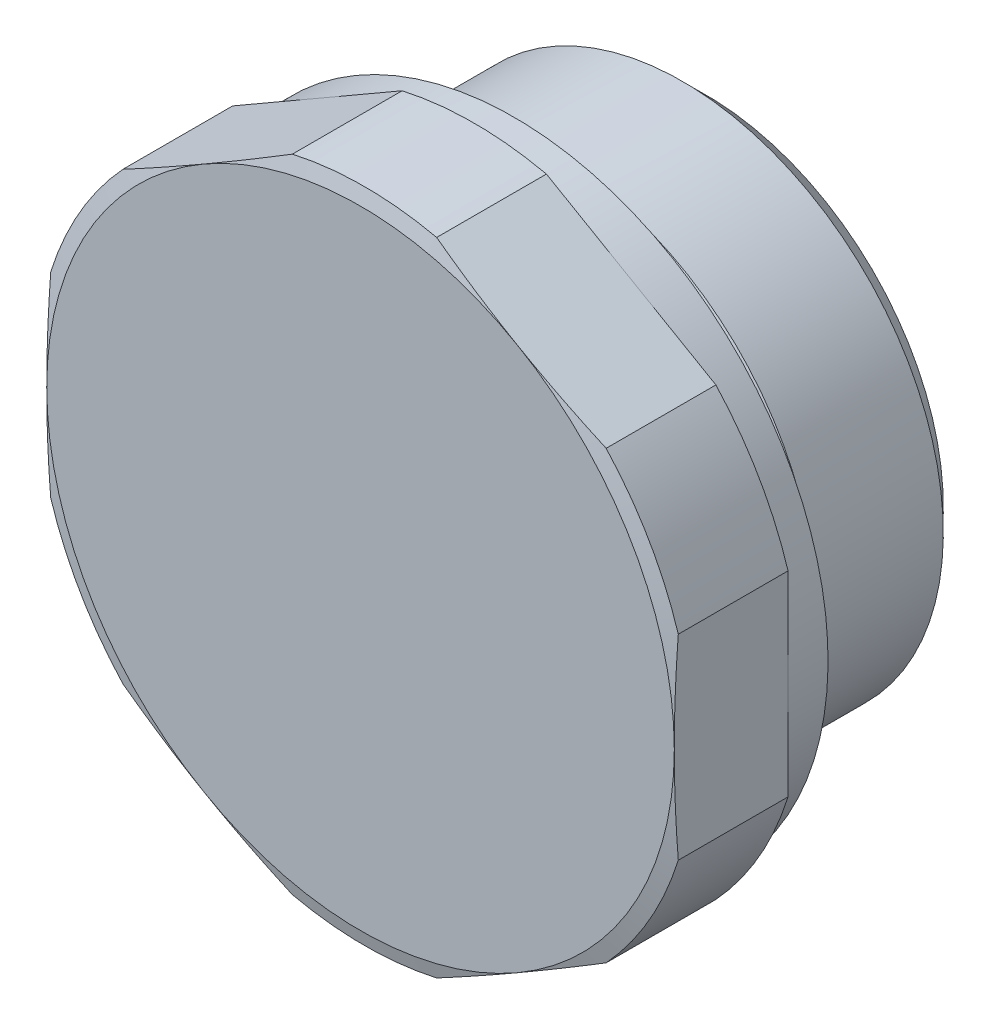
ISO-10303-21;
HEADER;
FILE_DESCRIPTION(('STEP AP214'),'2;1');
FILE_NAME('part.step','',(''),(''),'','','');
FILE_SCHEMA(('AUTOMOTIVE_DESIGN { 1 0 10303 214 1 1 1 1 }'));
ENDSEC;
DATA;
#1=APPLICATION_CONTEXT('core data for automotive mechanical design processes');
#2=APPLICATION_PROTOCOL_DEFINITION('international standard','automotive_design',2000,#1);
#3=PRODUCT_CONTEXT('',#1,'mechanical');
#4=PRODUCT('Part','Part','',(#3));
#5=PRODUCT_RELATED_PRODUCT_CATEGORY('part','',(#4));
#6=PRODUCT_DEFINITION_FORMATION('','',#4);
#7=PRODUCT_DEFINITION_CONTEXT('part definition',#1,'design');
#8=PRODUCT_DEFINITION('design','',#6,#7);
#9=PRODUCT_DEFINITION_SHAPE('','',#8);
#10=(LENGTH_UNIT() NAMED_UNIT(*) SI_UNIT(.MILLI.,.METRE.));
#11=(NAMED_UNIT(*) PLANE_ANGLE_UNIT() SI_UNIT($,.RADIAN.));
#12=(NAMED_UNIT(*) SI_UNIT($,.STERADIAN.) SOLID_ANGLE_UNIT());
#13=UNCERTAINTY_MEASURE_WITH_UNIT(LENGTH_MEASURE(1.E-05),#10,'distance_accuracy_value','');
#14=(GEOMETRIC_REPRESENTATION_CONTEXT(3) GLOBAL_UNCERTAINTY_ASSIGNED_CONTEXT((#13)) GLOBAL_UNIT_ASSIGNED_CONTEXT((#10,
#11,#12)) REPRESENTATION_CONTEXT('',''));
#15=CARTESIAN_POINT('',(0.,0.,0.));
#16=DIRECTION('',(0.,0.,1.));
#17=DIRECTION('',(1.,0.,0.));
#18=AXIS2_PLACEMENT_3D('',#15,#16,#17);
#19=CARTESIAN_POINT('',(0.,0.,-6.99999999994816));
#20=DIRECTION('',(0.,0.,-1.));
#21=DIRECTION('',(1.,0.,0.));
#22=AXIS2_PLACEMENT_3D('',#19,#20,#21);
#23=CONICAL_SURFACE('',#22,6.50000000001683,1.02974425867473);
#24=CARTESIAN_POINT('',(0.,0.,-3.09440597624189));
#25=VERTEX_POINT('',#24);
#26=VERTEX_LOOP('',#25);
#27=FACE_BOUND('',#26,.T.);
#28=CARTESIAN_POINT('',(0.,0.,-7.));
#29=DIRECTION('',(0.,0.,1.));
#30=DIRECTION('',(0.,-1.,0.));
#31=AXIS2_PLACEMENT_3D('',#28,#29,#30);
#32=CIRCLE('',#31,6.5);
#33=CARTESIAN_POINT('',(0.,-6.5,-7.));
#34=VERTEX_POINT('',#33);
#35=EDGE_CURVE('E410',#34,#34,#32,.F.);
#36=ORIENTED_EDGE('',*,*,#35,.T.);
#37=EDGE_LOOP('',(#36));
#38=FACE_BOUND('',#37,.T.);
#39=ADVANCED_FACE('F14',(#27,#38),#23,.F.);
#40=CARTESIAN_POINT('',(0.,0.,-14.));
#41=DIRECTION('',(0.,0.,1.));
#42=DIRECTION('',(0.,-1.,0.));
#43=AXIS2_PLACEMENT_3D('',#40,#41,#42);
#44=CYLINDRICAL_SURFACE('',#43,6.5);
#45=CARTESIAN_POINT('',(0.,0.,-14.));
#46=DIRECTION('',(0.,0.,1.));
#47=DIRECTION('',(0.,-1.,0.));
#48=AXIS2_PLACEMENT_3D('',#45,#46,#47);
#49=CIRCLE('',#48,6.5);
#50=CARTESIAN_POINT('',(0.,-6.5,-14.));
#51=VERTEX_POINT('',#50);
#52=EDGE_CURVE('E17',#51,#51,#49,.F.);
#53=ORIENTED_EDGE('',*,*,#52,.T.);
#54=EDGE_LOOP('',(#53));
#55=FACE_BOUND('',#54,.T.);
#56=ORIENTED_EDGE('',*,*,#35,.F.);
#57=EDGE_LOOP('',(#56));
#58=FACE_BOUND('',#57,.T.);
#59=ADVANCED_FACE('F753',(#55,#58),#44,.F.);
#60=CARTESIAN_POINT('',(15.1455,0.,-14.));
#61=DIRECTION('',(0.,0.,1.));
#62=DIRECTION('',(0.,-1.,0.));
#63=AXIS2_PLACEMENT_3D('',#60,#61,#62);
#64=PLANE('',#63);
#65=CARTESIAN_POINT('',(0.,0.,-14.));
#66=DIRECTION('',(0.,0.,1.));
#67=DIRECTION('',(0.,-1.,0.));
#68=AXIS2_PLACEMENT_3D('',#65,#66,#67);
#69=CIRCLE('',#68,15.1455);
#70=CARTESIAN_POINT('',(0.,-15.1455,-14.));
#71=VERTEX_POINT('',#70);
#72=EDGE_CURVE('E407',#71,#71,#69,.T.);
#73=ORIENTED_EDGE('',*,*,#72,.F.);
#74=EDGE_LOOP('',(#73));
#75=FACE_BOUND('',#74,.T.);
#76=ORIENTED_EDGE('',*,*,#52,.F.);
#77=EDGE_LOOP('',(#76));
#78=FACE_BOUND('',#77,.T.);
#79=ADVANCED_FACE('F744',(#75,#78),#64,.F.);
#80=CARTESIAN_POINT('',(0.,0.,-12.521));
#81=DIRECTION('',(0.,0.,1.));
#82=DIRECTION('',(0.,-1.,0.));
#83=AXIS2_PLACEMENT_3D('',#80,#81,#82);
#84=CONICAL_SURFACE('',#83,16.6245,0.785398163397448);
#85=CARTESIAN_POINT('',(0.,0.,-12.521));
#86=DIRECTION('',(0.,0.,1.));
#87=DIRECTION('',(0.,-1.,0.));
#88=AXIS2_PLACEMENT_3D('',#85,#86,#87);
#89=CIRCLE('',#88,16.6245);
#90=CARTESIAN_POINT('',(0.,-16.6245,-12.521));
#91=VERTEX_POINT('',#90);
#92=EDGE_CURVE('E402',#91,#91,#89,.T.);
#93=ORIENTED_EDGE('',*,*,#92,.F.);
#94=EDGE_LOOP('',(#93));
#95=FACE_BOUND('',#94,.T.);
#96=ORIENTED_EDGE('',*,*,#72,.T.);
#97=EDGE_LOOP('',(#96));
#98=FACE_BOUND('',#97,.T.);
#99=ADVANCED_FACE('F735',(#95,#98),#84,.T.);
#100=CARTESIAN_POINT('',(0.,0.,-14.));
#101=DIRECTION('',(0.,0.,1.));
#102=DIRECTION('',(0.,-1.,0.));
#103=AXIS2_PLACEMENT_3D('',#100,#101,#102);
#104=CYLINDRICAL_SURFACE('',#103,16.6245);
#105=CARTESIAN_POINT('',(0.,0.,-4.35390104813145));
#106=DIRECTION('',(0.,0.,-1.));
#107=DIRECTION('',(0.,1.,0.));
#108=AXIS2_PLACEMENT_3D('',#105,#106,#107);
#109=CIRCLE('',#108,16.6245);
#110=CARTESIAN_POINT('',(0.,16.6245,-4.35390104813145));
#111=VERTEX_POINT('',#110);
#112=EDGE_CURVE('E398',#111,#111,#109,.F.);
#113=ORIENTED_EDGE('',*,*,#112,.F.);
#114=EDGE_LOOP('',(#113));
#115=FACE_BOUND('',#114,.T.);
#116=ORIENTED_EDGE('',*,*,#92,.T.);
#117=EDGE_LOOP('',(#116));
#118=FACE_BOUND('',#117,.T.);
#119=ADVANCED_FACE('F726',(#115,#118),#104,.T.);
#120=CARTESIAN_POINT('',(0.,0.,-4.35390104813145));
#121=DIRECTION('',(0.,0.,-1.));
#122=DIRECTION('',(0.,1.,0.));
#123=AXIS2_PLACEMENT_3D('',#120,#121,#122);
#124=CONICAL_SURFACE('',#123,16.6245,1.0471975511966);
#125=CARTESIAN_POINT('',(0.,0.,-3.5));
#126=DIRECTION('',(0.,0.,-1.));
#127=DIRECTION('',(0.,1.,0.));
#128=AXIS2_PLACEMENT_3D('',#125,#126,#127);
#129=CIRCLE('',#128,15.1455);
#130=CARTESIAN_POINT('',(0.,15.1455,-3.5));
#131=VERTEX_POINT('',#130);
#132=EDGE_CURVE('E401',#131,#131,#129,.T.);
#133=ORIENTED_EDGE('',*,*,#132,.T.);
#134=EDGE_LOOP('',(#133));
#135=FACE_BOUND('',#134,.T.);
#136=ORIENTED_EDGE('',*,*,#112,.T.);
#137=EDGE_LOOP('',(#136));
#138=FACE_BOUND('',#137,.T.);
#139=ADVANCED_FACE('F717',(#135,#138),#124,.T.);
#140=CARTESIAN_POINT('',(14.5,0.,-3.5));
#141=DIRECTION('',(0.,0.,-1.));
#142=DIRECTION('',(0.,1.,0.));
#143=AXIS2_PLACEMENT_3D('',#140,#141,#142);
#144=PLANE('',#143);
#145=CARTESIAN_POINT('',(0.,0.,-3.5));
#146=DIRECTION('',(0.,0.,1.));
#147=DIRECTION('',(-1.,0.,0.));
#148=AXIS2_PLACEMENT_3D('',#145,#146,#147);
#149=CIRCLE('',#148,14.5);
#150=CARTESIAN_POINT('',(-14.5,0.,-3.5));
#151=VERTEX_POINT('',#150);
#152=EDGE_CURVE('E425',#151,#151,#149,.T.);
#153=ORIENTED_EDGE('',*,*,#152,.F.);
#154=EDGE_LOOP('',(#153));
#155=FACE_BOUND('',#154,.T.);
#156=ORIENTED_EDGE('',*,*,#132,.F.);
#157=EDGE_LOOP('',(#156));
#158=FACE_BOUND('',#157,.T.);
#159=ADVANCED_FACE('F708',(#155,#158),#144,.F.);
#160=CARTESIAN_POINT('',(0.,0.,0.));
#161=DIRECTION('',(0.,0.,1.));
#162=DIRECTION('',(-1.,0.,0.));
#163=AXIS2_PLACEMENT_3D('',#160,#161,#162);
#164=CONICAL_SURFACE('',#163,16.5,0.519146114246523);
#165=CARTESIAN_POINT('',(0.,0.,0.));
#166=DIRECTION('',(0.,0.,1.));
#167=DIRECTION('',(-1.,0.,0.));
#168=AXIS2_PLACEMENT_3D('',#165,#166,#167);
#169=CIRCLE('',#168,16.5);
#170=CARTESIAN_POINT('',(-16.5,0.,0.));
#171=VERTEX_POINT('',#170);
#172=EDGE_CURVE('E428',#171,#171,#169,.F.);
#173=ORIENTED_EDGE('',*,*,#172,.T.);
#174=EDGE_LOOP('',(#173));
#175=FACE_BOUND('',#174,.T.);
#176=ORIENTED_EDGE('',*,*,#152,.T.);
#177=EDGE_LOOP('',(#176));
#178=FACE_BOUND('',#177,.T.);
#179=ADVANCED_FACE('F699',(#175,#178),#164,.T.);
#180=CARTESIAN_POINT('',(20.,0.,0.));
#181=DIRECTION('',(0.,0.,1.));
#182=DIRECTION('',(0.,-1.,0.));
#183=AXIS2_PLACEMENT_3D('',#180,#181,#182);
#184=PLANE('',#183);
#185=CARTESIAN_POINT('',(0.,0.,0.));
#186=DIRECTION('',(0.,0.,1.));
#187=DIRECTION('',(0.,-1.,0.));
#188=AXIS2_PLACEMENT_3D('',#185,#186,#187);
#189=CIRCLE('',#188,16.6245);
#190=CARTESIAN_POINT('',(0.,-16.6245,0.));
#191=VERTEX_POINT('',#190);
#192=EDGE_CURVE('E431',#191,#191,#189,.F.);
#193=ORIENTED_EDGE('',*,*,#192,.T.);
#194=EDGE_LOOP('',(#193));
#195=FACE_BOUND('',#194,.T.);
#196=ORIENTED_EDGE('',*,*,#172,.F.);
#197=EDGE_LOOP('',(#196));
#198=FACE_BOUND('',#197,.T.);
#199=ADVANCED_FACE('F690',(#195,#198),#184,.F.);
#200=CARTESIAN_POINT('',(0.,0.,-1.8));
#201=DIRECTION('',(0.,0.,1.));
#202=DIRECTION('',(0.,-1.,0.));
#203=AXIS2_PLACEMENT_3D('',#200,#201,#202);
#204=CYLINDRICAL_SURFACE('',#203,16.6245);
#205=ORIENTED_EDGE('',*,*,#192,.F.);
#206=EDGE_LOOP('',(#205));
#207=FACE_BOUND('',#206,.T.);
#208=CARTESIAN_POINT('',(0.,0.,-1.8));
#209=DIRECTION('',(0.,0.,1.));
#210=DIRECTION('',(0.,-1.,0.));
#211=AXIS2_PLACEMENT_3D('',#208,#209,#210);
#212=CIRCLE('',#211,16.6245);
#213=CARTESIAN_POINT('',(0.,-16.6245,-1.8));
#214=VERTEX_POINT('',#213);
#215=EDGE_CURVE('E434',#214,#214,#212,.T.);
#216=ORIENTED_EDGE('',*,*,#215,.F.);
#217=EDGE_LOOP('',(#216));
#218=FACE_BOUND('',#217,.T.);
#219=ADVANCED_FACE('F681',(#207,#218),#204,.F.);
#220=CARTESIAN_POINT('',(16.6245,0.,-1.8));
#221=DIRECTION('',(0.,0.,-1.));
#222=DIRECTION('',(0.,1.,0.));
#223=AXIS2_PLACEMENT_3D('',#220,#221,#222);
#224=PLANE('',#223);
#225=ORIENTED_EDGE('',*,*,#215,.T.);
#226=EDGE_LOOP('',(#225));
#227=FACE_BOUND('',#226,.T.);
#228=CARTESIAN_POINT('',(0.,0.,-1.8));
#229=DIRECTION('',(0.,0.,1.));
#230=DIRECTION('',(0.,-1.,0.));
#231=AXIS2_PLACEMENT_3D('',#228,#229,#230);
#232=CIRCLE('',#231,20.);
#233=CARTESIAN_POINT('',(0.,-20.,-1.8));
#234=VERTEX_POINT('',#233);
#235=EDGE_CURVE('E437',#234,#234,#232,.T.);
#236=ORIENTED_EDGE('',*,*,#235,.F.);
#237=EDGE_LOOP('',(#236));
#238=FACE_BOUND('',#237,.T.);
#239=ADVANCED_FACE('F673',(#227,#238),#224,.T.);
#240=CARTESIAN_POINT('',(0.,0.,-14.));
#241=DIRECTION('',(0.,0.,1.));
#242=DIRECTION('',(0.,-1.,0.));
#243=AXIS2_PLACEMENT_3D('',#240,#241,#242);
#244=CYLINDRICAL_SURFACE('',#243,20.);
#245=CARTESIAN_POINT('',(0.,0.,0.75));
#246=DIRECTION('',(0.,0.,1.));
#247=DIRECTION('',(0.,-1.,0.));
#248=AXIS2_PLACEMENT_3D('',#245,#246,#247);
#249=CIRCLE('',#248,20.);
#250=CARTESIAN_POINT('',(-10.,17.3205080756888,0.75));
#251=VERTEX_POINT('',#250);
#252=CARTESIAN_POINT('',(10.,17.3205080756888,0.75));
#253=VERTEX_POINT('',#252);
#254=EDGE_CURVE('E444',#251,#253,#249,.F.);
#255=ORIENTED_EDGE('',*,*,#254,.T.);
#256=CARTESIAN_POINT('',(0.,0.,0.75));
#257=DIRECTION('',(0.,0.,1.));
#258=DIRECTION('',(0.,-1.,0.));
#259=AXIS2_PLACEMENT_3D('',#256,#257,#258);
#260=CIRCLE('',#259,20.);
#261=CARTESIAN_POINT('',(20.,0.,0.75));
#262=VERTEX_POINT('',#261);
#263=EDGE_CURVE('E447',#253,#262,#260,.F.);
#264=ORIENTED_EDGE('',*,*,#263,.T.);
#265=CARTESIAN_POINT('',(0.,0.,0.75));
#266=DIRECTION('',(0.,0.,1.));
#267=DIRECTION('',(0.,-1.,0.));
#268=AXIS2_PLACEMENT_3D('',#265,#266,#267);
#269=CIRCLE('',#268,20.);
#270=CARTESIAN_POINT('',(10.,-17.3205080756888,0.75));
#271=VERTEX_POINT('',#270);
#272=EDGE_CURVE('E450',#262,#271,#269,.F.);
#273=ORIENTED_EDGE('',*,*,#272,.T.);
#274=CARTESIAN_POINT('',(0.,0.,0.75));
#275=DIRECTION('',(0.,0.,1.));
#276=DIRECTION('',(0.,-1.,0.));
#277=AXIS2_PLACEMENT_3D('',#274,#275,#276);
#278=CIRCLE('',#277,20.);
#279=CARTESIAN_POINT('',(-10.,-17.3205080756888,0.75));
#280=VERTEX_POINT('',#279);
#281=EDGE_CURVE('E453',#271,#280,#278,.F.);
#282=ORIENTED_EDGE('',*,*,#281,.T.);
#283=CARTESIAN_POINT('',(0.,0.,0.75));
#284=DIRECTION('',(0.,0.,1.));
#285=DIRECTION('',(0.,-1.,0.));
#286=AXIS2_PLACEMENT_3D('',#283,#284,#285);
#287=CIRCLE('',#286,20.);
#288=CARTESIAN_POINT('',(-20.,0.,0.75));
#289=VERTEX_POINT('',#288);
#290=EDGE_CURVE('E136',#280,#289,#287,.F.);
#291=ORIENTED_EDGE('',*,*,#290,.T.);
#292=CARTESIAN_POINT('',(0.,0.,0.75));
#293=DIRECTION('',(0.,0.,1.));
#294=DIRECTION('',(0.,-1.,0.));
#295=AXIS2_PLACEMENT_3D('',#292,#293,#294);
#296=CIRCLE('',#295,20.);
#297=EDGE_CURVE('E441',#289,#251,#296,.F.);
#298=ORIENTED_EDGE('',*,*,#297,.T.);
#299=EDGE_LOOP('',(#255,#264,#273,#282,#291,#298));
#300=FACE_BOUND('',#299,.T.);
#301=ORIENTED_EDGE('',*,*,#235,.T.);
#302=EDGE_LOOP('',(#301));
#303=FACE_BOUND('',#302,.T.);
#304=ADVANCED_FACE('F474',(#300,#303),#244,.T.);
#305=CARTESIAN_POINT('',(23.95,0.,0.75));
#306=DIRECTION('',(0.,0.,1.));
#307=DIRECTION('',(0.,-1.,0.));
#308=AXIS2_PLACEMENT_3D('',#305,#306,#307);
#309=PLANE('',#308);
#310=DIRECTION('',(0.,-1.,0.));
#311=VECTOR('',#310,1.);
#312=CARTESIAN_POINT('',(-20.,11.5470053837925,0.75));
#313=LINE('',#312,#311);
#314=CARTESIAN_POINT('',(-20.,-6.23718686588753,0.75));
#315=VERTEX_POINT('',#314);
#316=EDGE_CURVE('E387',#289,#315,#313,.T.);
#317=ORIENTED_EDGE('',*,*,#316,.F.);
#318=ORIENTED_EDGE('',*,*,#290,.F.);
#319=DIRECTION('',(0.866025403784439,-0.5,0.));
#320=VECTOR('',#319,1.);
#321=CARTESIAN_POINT('',(-20.,-11.5470053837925,0.75));
#322=LINE('',#321,#320);
#323=CARTESIAN_POINT('',(-15.4015622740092,-14.201914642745,0.75));
#324=VERTEX_POINT('',#323);
#325=EDGE_CURVE('E391',#324,#280,#322,.T.);
#326=ORIENTED_EDGE('',*,*,#325,.F.);
#327=CARTESIAN_POINT('',(0.,0.,0.75));
#328=DIRECTION('',(0.,0.,-1.));
#329=DIRECTION('',(0.,1.,0.));
#330=AXIS2_PLACEMENT_3D('',#327,#328,#329);
#331=CIRCLE('',#330,20.95);
#332=EDGE_CURVE('E397',#315,#324,#331,.F.);
#333=ORIENTED_EDGE('',*,*,#332,.F.);
#334=EDGE_LOOP('',(#317,#318,#326,#333));
#335=FACE_BOUND('',#334,.T.);
#336=ADVANCED_FACE('F657',(#335),#309,.F.);
#337=CARTESIAN_POINT('',(23.95,0.,0.75));
#338=DIRECTION('',(0.,0.,1.));
#339=DIRECTION('',(0.,-1.,0.));
#340=AXIS2_PLACEMENT_3D('',#337,#338,#339);
#341=PLANE('',#340);
#342=DIRECTION('',(-0.866025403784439,-0.5,0.));
#343=VECTOR('',#342,1.);
#344=CARTESIAN_POINT('',(0.,23.094010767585,0.75));
#345=LINE('',#344,#343);
#346=CARTESIAN_POINT('',(-15.4015622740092,14.201914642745,0.75));
#347=VERTEX_POINT('',#346);
#348=EDGE_CURVE('E379',#251,#347,#345,.T.);
#349=ORIENTED_EDGE('',*,*,#348,.F.);
#350=ORIENTED_EDGE('',*,*,#297,.F.);
#351=DIRECTION('',(0.,-1.,0.));
#352=VECTOR('',#351,1.);
#353=CARTESIAN_POINT('',(-20.,11.5470053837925,0.75));
#354=LINE('',#353,#352);
#355=CARTESIAN_POINT('',(-20.,6.23718686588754,0.75));
#356=VERTEX_POINT('',#355);
#357=EDGE_CURVE('E383',#356,#289,#354,.T.);
#358=ORIENTED_EDGE('',*,*,#357,.F.);
#359=CARTESIAN_POINT('',(0.,0.,0.75));
#360=DIRECTION('',(0.,0.,-1.));
#361=DIRECTION('',(0.,1.,0.));
#362=AXIS2_PLACEMENT_3D('',#359,#360,#361);
#363=CIRCLE('',#362,20.95);
#364=EDGE_CURVE('E390',#347,#356,#363,.F.);
#365=ORIENTED_EDGE('',*,*,#364,.F.);
#366=EDGE_LOOP('',(#349,#350,#358,#365));
#367=FACE_BOUND('',#366,.T.);
#368=ADVANCED_FACE('F649',(#367),#341,.F.);
#369=CARTESIAN_POINT('',(23.95,0.,0.75));
#370=DIRECTION('',(0.,0.,1.));
#371=DIRECTION('',(0.,-1.,0.));
#372=AXIS2_PLACEMENT_3D('',#369,#370,#371);
#373=PLANE('',#372);
#374=DIRECTION('',(-0.866025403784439,0.5,0.));
#375=VECTOR('',#374,1.);
#376=CARTESIAN_POINT('',(20.,11.5470053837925,0.75));
#377=LINE('',#376,#375);
#378=CARTESIAN_POINT('',(4.59843772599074,20.4391015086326,0.75));
#379=VERTEX_POINT('',#378);
#380=EDGE_CURVE('E371',#253,#379,#377,.T.);
#381=ORIENTED_EDGE('',*,*,#380,.F.);
#382=ORIENTED_EDGE('',*,*,#254,.F.);
#383=DIRECTION('',(-0.866025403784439,-0.5,0.));
#384=VECTOR('',#383,1.);
#385=CARTESIAN_POINT('',(0.,23.094010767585,0.75));
#386=LINE('',#385,#384);
#387=CARTESIAN_POINT('',(-4.59843772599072,20.4391015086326,0.75));
#388=VERTEX_POINT('',#387);
#389=EDGE_CURVE('E375',#388,#251,#386,.T.);
#390=ORIENTED_EDGE('',*,*,#389,.F.);
#391=CARTESIAN_POINT('',(0.,0.,0.75));
#392=DIRECTION('',(0.,0.,-1.));
#393=DIRECTION('',(0.,1.,0.));
#394=AXIS2_PLACEMENT_3D('',#391,#392,#393);
#395=CIRCLE('',#394,20.95);
#396=EDGE_CURVE('E382',#379,#388,#395,.F.);
#397=ORIENTED_EDGE('',*,*,#396,.F.);
#398=EDGE_LOOP('',(#381,#382,#390,#397));
#399=FACE_BOUND('',#398,.T.);
#400=ADVANCED_FACE('F479',(#399),#373,.F.);
#401=CARTESIAN_POINT('',(23.95,0.,0.75));
#402=DIRECTION('',(0.,0.,1.));
#403=DIRECTION('',(0.,-1.,0.));
#404=AXIS2_PLACEMENT_3D('',#401,#402,#403);
#405=PLANE('',#404);
#406=DIRECTION('',(0.,1.,0.));
#407=VECTOR('',#406,1.);
#408=CARTESIAN_POINT('',(20.,-11.5470053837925,0.75));
#409=LINE('',#408,#407);
#410=CARTESIAN_POINT('',(20.,6.23718686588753,0.75));
#411=VERTEX_POINT('',#410);
#412=EDGE_CURVE('E365',#262,#411,#409,.T.);
#413=ORIENTED_EDGE('',*,*,#412,.F.);
#414=ORIENTED_EDGE('',*,*,#263,.F.);
#415=DIRECTION('',(-0.866025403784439,0.5,0.));
#416=VECTOR('',#415,1.);
#417=CARTESIAN_POINT('',(20.,11.5470053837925,0.75));
#418=LINE('',#417,#416);
#419=CARTESIAN_POINT('',(15.4015622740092,14.201914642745,0.75));
#420=VERTEX_POINT('',#419);
#421=EDGE_CURVE('E367',#420,#253,#418,.T.);
#422=ORIENTED_EDGE('',*,*,#421,.F.);
#423=CARTESIAN_POINT('',(0.,0.,0.75));
#424=DIRECTION('',(0.,0.,-1.));
#425=DIRECTION('',(0.,1.,0.));
#426=AXIS2_PLACEMENT_3D('',#423,#424,#425);
#427=CIRCLE('',#426,20.95);
#428=EDGE_CURVE('E374',#411,#420,#427,.F.);
#429=ORIENTED_EDGE('',*,*,#428,.F.);
#430=EDGE_LOOP('',(#413,#414,#422,#429));
#431=FACE_BOUND('',#430,.T.);
#432=ADVANCED_FACE('F472',(#431),#405,.F.);
#433=CARTESIAN_POINT('',(23.95,0.,0.75));
#434=DIRECTION('',(0.,0.,1.));
#435=DIRECTION('',(0.,-1.,0.));
#436=AXIS2_PLACEMENT_3D('',#433,#434,#435);
#437=PLANE('',#436);
#438=DIRECTION('',(0.866025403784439,0.5,0.));
#439=VECTOR('',#438,1.);
#440=CARTESIAN_POINT('',(0.,-23.094010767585,0.75));
#441=LINE('',#440,#439);
#442=CARTESIAN_POINT('',(15.4015622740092,-14.201914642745,0.75));
#443=VERTEX_POINT('',#442);
#444=EDGE_CURVE('E362',#271,#443,#441,.T.);
#445=ORIENTED_EDGE('',*,*,#444,.F.);
#446=ORIENTED_EDGE('',*,*,#272,.F.);
#447=DIRECTION('',(0.,1.,0.));
#448=VECTOR('',#447,1.);
#449=CARTESIAN_POINT('',(20.,-11.5470053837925,0.75));
#450=LINE('',#449,#448);
#451=CARTESIAN_POINT('',(20.,-6.23718686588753,0.75));
#452=VERTEX_POINT('',#451);
#453=EDGE_CURVE('E163',#452,#262,#450,.T.);
#454=ORIENTED_EDGE('',*,*,#453,.F.);
#455=CARTESIAN_POINT('',(0.,0.,0.75));
#456=DIRECTION('',(0.,0.,-1.));
#457=DIRECTION('',(0.,1.,0.));
#458=AXIS2_PLACEMENT_3D('',#455,#456,#457);
#459=CIRCLE('',#458,20.95);
#460=EDGE_CURVE('E159',#443,#452,#459,.F.);
#461=ORIENTED_EDGE('',*,*,#460,.F.);
#462=EDGE_LOOP('',(#445,#446,#454,#461));
#463=FACE_BOUND('',#462,.T.);
#464=ADVANCED_FACE('F625',(#463),#437,.F.);
#465=CARTESIAN_POINT('',(23.95,0.,0.75));
#466=DIRECTION('',(0.,0.,1.));
#467=DIRECTION('',(0.,-1.,0.));
#468=AXIS2_PLACEMENT_3D('',#465,#466,#467);
#469=PLANE('',#468);
#470=DIRECTION('',(0.866025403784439,-0.5,0.));
#471=VECTOR('',#470,1.);
#472=CARTESIAN_POINT('',(-20.,-11.5470053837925,0.75));
#473=LINE('',#472,#471);
#474=CARTESIAN_POINT('',(-4.59843772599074,-20.4391015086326,0.75));
#475=VERTEX_POINT('',#474);
#476=EDGE_CURVE('E395',#280,#475,#473,.T.);
#477=ORIENTED_EDGE('',*,*,#476,.F.);
#478=ORIENTED_EDGE('',*,*,#281,.F.);
#479=DIRECTION('',(0.866025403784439,0.5,0.));
#480=VECTOR('',#479,1.);
#481=CARTESIAN_POINT('',(0.,-23.094010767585,0.75));
#482=LINE('',#481,#480);
#483=CARTESIAN_POINT('',(4.59843772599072,-20.4391015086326,0.75));
#484=VERTEX_POINT('',#483);
#485=EDGE_CURVE('E355',#484,#271,#482,.T.);
#486=ORIENTED_EDGE('',*,*,#485,.F.);
#487=CARTESIAN_POINT('',(0.,0.,0.75));
#488=DIRECTION('',(0.,0.,-1.));
#489=DIRECTION('',(0.,1.,0.));
#490=AXIS2_PLACEMENT_3D('',#487,#488,#489);
#491=CIRCLE('',#490,20.95);
#492=EDGE_CURVE('E455',#475,#484,#491,.F.);
#493=ORIENTED_EDGE('',*,*,#492,.F.);
#494=EDGE_LOOP('',(#477,#478,#486,#493));
#495=FACE_BOUND('',#494,.T.);
#496=ADVANCED_FACE('F618',(#495),#469,.F.);
#497=CARTESIAN_POINT('',(0.,0.,0.));
#498=DIRECTION('',(0.,0.,-1.));
#499=DIRECTION('',(0.,1.,0.));
#500=AXIS2_PLACEMENT_3D('',#497,#498,#499);
#501=CYLINDRICAL_SURFACE('',#500,20.95);
#502=CARTESIAN_POINT('',(0.,0.,7.74544826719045));
#503=DIRECTION('',(0.,0.,-1.));
#504=DIRECTION('',(0.,1.,0.));
#505=AXIS2_PLACEMENT_3D('',#502,#503,#504);
#506=CIRCLE('',#505,20.95);
#507=CARTESIAN_POINT('',(-4.59843772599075,-20.4391015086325,7.74544826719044));
#508=VERTEX_POINT('',#507);
#509=CARTESIAN_POINT('',(4.59843772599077,-20.4391015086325,7.74544826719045));
#510=VERTEX_POINT('',#509);
#511=EDGE_CURVE('E354',#508,#510,#506,.F.);
#512=ORIENTED_EDGE('',*,*,#511,.F.);
#513=DIRECTION('',(0.,0.,1.));
#514=VECTOR('',#513,1.);
#515=CARTESIAN_POINT('',(-4.59843772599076,-20.4391015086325,0.));
#516=LINE('',#515,#514);
#517=EDGE_CURVE('E359',#475,#508,#516,.T.);
#518=ORIENTED_EDGE('',*,*,#517,.F.);
#519=ORIENTED_EDGE('',*,*,#492,.T.);
#520=DIRECTION('',(0.,0.,1.));
#521=VECTOR('',#520,1.);
#522=CARTESIAN_POINT('',(4.59843772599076,-20.4391015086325,0.));
#523=LINE('',#522,#521);
#524=EDGE_CURVE('E352',#510,#484,#523,.F.);
#525=ORIENTED_EDGE('',*,*,#524,.F.);
#526=EDGE_LOOP('',(#512,#518,#519,#525));
#527=FACE_BOUND('',#526,.T.);
#528=ADVANCED_FACE('F502',(#527),#501,.T.);
#529=CARTESIAN_POINT('',(0.,0.,0.));
#530=DIRECTION('',(0.,0.,-1.));
#531=DIRECTION('',(0.,1.,0.));
#532=AXIS2_PLACEMENT_3D('',#529,#530,#531);
#533=CYLINDRICAL_SURFACE('',#532,20.95);
#534=CARTESIAN_POINT('',(0.,0.,7.74544826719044));
#535=DIRECTION('',(0.,0.,-1.));
#536=DIRECTION('',(0.,1.,0.));
#537=AXIS2_PLACEMENT_3D('',#534,#535,#536);
#538=CIRCLE('',#537,20.95);
#539=CARTESIAN_POINT('',(-20.,-6.23718686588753,7.74544826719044));
#540=VERTEX_POINT('',#539);
#541=CARTESIAN_POINT('',(-15.4015622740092,-14.201914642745,7.74544826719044));
#542=VERTEX_POINT('',#541);
#543=EDGE_CURVE('E300',#540,#542,#538,.F.);
#544=ORIENTED_EDGE('',*,*,#543,.F.);
#545=DIRECTION('',(0.,0.,1.));
#546=VECTOR('',#545,1.);
#547=CARTESIAN_POINT('',(-20.,-6.23718686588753,0.));
#548=LINE('',#547,#546);
#549=EDGE_CURVE('E389',#315,#540,#548,.T.);
#550=ORIENTED_EDGE('',*,*,#549,.F.);
#551=ORIENTED_EDGE('',*,*,#332,.T.);
#552=DIRECTION('',(0.,0.,1.));
#553=VECTOR('',#552,1.);
#554=CARTESIAN_POINT('',(-15.4015622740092,-14.201914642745,0.));
#555=LINE('',#554,#553);
#556=EDGE_CURVE('E394',#542,#324,#555,.F.);
#557=ORIENTED_EDGE('',*,*,#556,.F.);
#558=EDGE_LOOP('',(#544,#550,#551,#557));
#559=FACE_BOUND('',#558,.T.);
#560=ADVANCED_FACE('F283',(#559),#533,.T.);
#561=CARTESIAN_POINT('',(-20.,-11.5470053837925,0.));
#562=DIRECTION('',(-0.5,-0.866025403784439,0.));
#563=DIRECTION('',(0.866025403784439,-0.5,0.));
#564=AXIS2_PLACEMENT_3D('',#561,#562,#563);
#565=PLANE('',#564);
#566=ORIENTED_EDGE('',*,*,#556,.T.);
#567=ORIENTED_EDGE('',*,*,#325,.T.);
#568=ORIENTED_EDGE('',*,*,#476,.T.);
#569=ORIENTED_EDGE('',*,*,#517,.T.);
#570=CARTESIAN_POINT('',(-10.,-17.3205080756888,8.));
#571=CARTESIAN_POINT('',(-9.54927598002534,-17.5807337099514,8.00003554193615));
#572=CARTESIAN_POINT('',(-9.09855595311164,-17.8409570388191,7.99455662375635));
#573=CARTESIAN_POINT('',(-8.19749000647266,-18.3611877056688,7.97284171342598));
#574=CARTESIAN_POINT('',(-7.74714400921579,-18.6211950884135,7.95661002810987));
#575=CARTESIAN_POINT('',(-6.8468429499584,-19.1409841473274,7.91366159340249));
#576=CARTESIAN_POINT('',(-6.39688787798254,-19.4007658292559,7.88694511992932));
#577=CARTESIAN_POINT('',(-5.49732244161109,-19.9201301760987,7.82354353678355));
#578=CARTESIAN_POINT('',(-5.04771228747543,-20.1797127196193,7.78685443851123));
#579=CARTESIAN_POINT('',(-4.59843772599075,-20.4391015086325,7.74544826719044));
#580=B_SPLINE_CURVE_WITH_KNOTS('',3,(#570,#571,#572,#573,#574,#575,#576,#577,#578,#579),
.UNSPECIFIED.,.F.,.F.,(4,2,2,2,4),(0.,1.56131785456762,3.12201072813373,4.68266253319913,
6.24393944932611),.UNSPECIFIED.);
#581=CARTESIAN_POINT('',(-10.,-17.3205080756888,8.));
#582=VERTEX_POINT('',#581);
#583=EDGE_CURVE('E293',#582,#508,#580,.T.);
#584=ORIENTED_EDGE('',*,*,#583,.F.);
#585=CARTESIAN_POINT('',(-15.4015622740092,-14.201914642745,7.74544826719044));
#586=CARTESIAN_POINT('',(-14.9522877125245,-14.4613034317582,7.78685443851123));
#587=CARTESIAN_POINT('',(-14.5026775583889,-14.7208859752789,7.82354353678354));
#588=CARTESIAN_POINT('',(-13.6031121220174,-15.2402503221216,7.88694511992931));
#589=CARTESIAN_POINT('',(-13.1531570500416,-15.5000320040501,7.91366159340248));
#590=CARTESIAN_POINT('',(-12.2528559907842,-16.019821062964,7.95661002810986));
#591=CARTESIAN_POINT('',(-11.8025099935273,-16.2798284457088,7.97284171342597));
#592=CARTESIAN_POINT('',(-10.9014440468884,-16.8000591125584,7.99455662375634));
#593=CARTESIAN_POINT('',(-10.4507240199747,-17.0602824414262,8.00003554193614));
#594=CARTESIAN_POINT('',(-10.,-17.3205080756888,8.));
#595=B_SPLINE_CURVE_WITH_KNOTS('',3,(#585,#586,#587,#588,#589,#590,#591,#592,#593,#594),
.UNSPECIFIED.,.F.,.F.,(4,2,2,2,4),(0.,1.56127691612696,3.12192872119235,4.68262159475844,
6.24393944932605),.UNSPECIFIED.);
#596=EDGE_CURVE('E287',#542,#582,#595,.T.);
#597=ORIENTED_EDGE('',*,*,#596,.F.);
#598=EDGE_LOOP('',(#566,#567,#568,#569,#584,#597));
#599=FACE_BOUND('',#598,.T.);
#600=ADVANCED_FACE('F278',(#599),#565,.T.);
#601=CARTESIAN_POINT('',(0.,0.,0.));
#602=DIRECTION('',(0.,0.,-1.));
#603=DIRECTION('',(0.,1.,0.));
#604=AXIS2_PLACEMENT_3D('',#601,#602,#603);
#605=CYLINDRICAL_SURFACE('',#604,20.95);
#606=CARTESIAN_POINT('',(0.,0.,7.74544826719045));
#607=DIRECTION('',(0.,0.,-1.));
#608=DIRECTION('',(0.,1.,0.));
#609=AXIS2_PLACEMENT_3D('',#606,#607,#608);
#610=CIRCLE('',#609,20.95);
#611=CARTESIAN_POINT('',(-15.4015622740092,14.201914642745,7.74544826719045));
#612=VERTEX_POINT('',#611);
#613=CARTESIAN_POINT('',(-20.,6.23718686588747,7.74544826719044));
#614=VERTEX_POINT('',#613);
#615=EDGE_CURVE('E260',#612,#614,#610,.F.);
#616=ORIENTED_EDGE('',*,*,#615,.F.);
#617=DIRECTION('',(0.,0.,1.));
#618=VECTOR('',#617,1.);
#619=CARTESIAN_POINT('',(-15.4015622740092,14.201914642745,0.));
#620=LINE('',#619,#618);
#621=EDGE_CURVE('E381',#347,#612,#620,.T.);
#622=ORIENTED_EDGE('',*,*,#621,.F.);
#623=ORIENTED_EDGE('',*,*,#364,.T.);
#624=DIRECTION('',(0.,0.,1.));
#625=VECTOR('',#624,1.);
#626=CARTESIAN_POINT('',(-20.,6.23718686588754,0.));
#627=LINE('',#626,#625);
#628=EDGE_CURVE('E386',#614,#356,#627,.F.);
#629=ORIENTED_EDGE('',*,*,#628,.F.);
#630=EDGE_LOOP('',(#616,#622,#623,#629));
#631=FACE_BOUND('',#630,.T.);
#632=ADVANCED_FACE('F273',(#631),#605,.T.);
#633=CARTESIAN_POINT('',(-20.,11.5470053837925,0.));
#634=DIRECTION('',(-1.,0.,0.));
#635=DIRECTION('',(0.,-1.,0.));
#636=AXIS2_PLACEMENT_3D('',#633,#634,#635);
#637=PLANE('',#636);
#638=ORIENTED_EDGE('',*,*,#628,.T.);
#639=ORIENTED_EDGE('',*,*,#357,.T.);
#640=ORIENTED_EDGE('',*,*,#316,.T.);
#641=ORIENTED_EDGE('',*,*,#549,.T.);
#642=CARTESIAN_POINT('',(-20.,0.,8.));
#643=CARTESIAN_POINT('',(-20.,-0.520451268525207,8.00003554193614));
#644=CARTESIAN_POINT('',(-20.,-1.04089792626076,7.99455662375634));
#645=CARTESIAN_POINT('',(-20.,-2.08135925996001,7.97284171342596));
#646=CARTESIAN_POINT('',(-20.,-2.60137402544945,7.95661002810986));
#647=CARTESIAN_POINT('',(-20.,-3.64095214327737,7.91366159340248));
#648=CARTESIAN_POINT('',(-20.,-4.16051550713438,7.8869451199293));
#649=CARTESIAN_POINT('',(-20.,-5.19924420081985,7.82354353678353));
#650=CARTESIAN_POINT('',(-20.,-5.71840928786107,7.78685443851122));
#651=CARTESIAN_POINT('',(-20.,-6.23718686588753,7.74544826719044));
#652=B_SPLINE_CURVE_WITH_KNOTS('',3,(#642,#643,#644,#645,#646,#647,#648,#649,#650,#651),
.UNSPECIFIED.,.F.,.F.,(4,2,2,2,4),(0.,1.56131785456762,3.12201072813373,4.68266253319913,
6.24393944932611),.UNSPECIFIED.);
#653=CARTESIAN_POINT('',(-20.,0.,8.));
#654=VERTEX_POINT('',#653);
#655=EDGE_CURVE('E261',#654,#540,#652,.T.);
#656=ORIENTED_EDGE('',*,*,#655,.F.);
#657=CARTESIAN_POINT('',(-20.,6.23718686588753,7.74544826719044));
#658=CARTESIAN_POINT('',(-20.,5.71840928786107,7.78685443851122));
#659=CARTESIAN_POINT('',(-20.,5.19924420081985,7.82354353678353));
#660=CARTESIAN_POINT('',(-20.,4.16051550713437,7.8869451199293));
#661=CARTESIAN_POINT('',(-20.,3.64095214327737,7.91366159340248));
#662=CARTESIAN_POINT('',(-20.,2.60137402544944,7.95661002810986));
#663=CARTESIAN_POINT('',(-20.,2.08135925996,7.97284171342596));
#664=CARTESIAN_POINT('',(-20.,1.04089792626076,7.99455662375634));
#665=CARTESIAN_POINT('',(-20.,0.520451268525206,8.00003554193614));
#666=CARTESIAN_POINT('',(-20.,0.,8.));
#667=B_SPLINE_CURVE_WITH_KNOTS('',3,(#657,#658,#659,#660,#661,#662,#663,#664,#665,#666),
.UNSPECIFIED.,.F.,.F.,(4,2,2,2,4),(0.,1.56127691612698,3.12192872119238,4.68262159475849,
6.24393944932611),.UNSPECIFIED.);
#668=EDGE_CURVE('E253',#614,#654,#667,.T.);
#669=ORIENTED_EDGE('',*,*,#668,.F.);
#670=EDGE_LOOP('',(#638,#639,#640,#641,#656,#669));
#671=FACE_BOUND('',#670,.T.);
#672=ADVANCED_FACE('F267',(#671),#637,.T.);
#673=CARTESIAN_POINT('',(0.,0.,0.));
#674=DIRECTION('',(0.,0.,-1.));
#675=DIRECTION('',(0.,1.,0.));
#676=AXIS2_PLACEMENT_3D('',#673,#674,#675);
#677=CYLINDRICAL_SURFACE('',#676,20.95);
#678=CARTESIAN_POINT('',(0.,0.,7.74544826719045));
#679=DIRECTION('',(0.,0.,-1.));
#680=DIRECTION('',(0.,1.,0.));
#681=AXIS2_PLACEMENT_3D('',#678,#679,#680);
#682=CIRCLE('',#681,20.95);
#683=CARTESIAN_POINT('',(4.59843772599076,20.4391015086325,7.74544826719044));
#684=VERTEX_POINT('',#683);
#685=CARTESIAN_POINT('',(-4.59843772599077,20.4391015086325,7.74544826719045));
#686=VERTEX_POINT('',#685);
#687=EDGE_CURVE('E486',#684,#686,#682,.F.);
#688=ORIENTED_EDGE('',*,*,#687,.F.);
#689=DIRECTION('',(0.,0.,1.));
#690=VECTOR('',#689,1.);
#691=CARTESIAN_POINT('',(4.59843772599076,20.4391015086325,0.));
#692=LINE('',#691,#690);
#693=EDGE_CURVE('E373',#379,#684,#692,.T.);
#694=ORIENTED_EDGE('',*,*,#693,.F.);
#695=ORIENTED_EDGE('',*,*,#396,.T.);
#696=DIRECTION('',(0.,0.,1.));
#697=VECTOR('',#696,1.);
#698=CARTESIAN_POINT('',(-4.59843772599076,20.4391015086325,0.));
#699=LINE('',#698,#697);
#700=EDGE_CURVE('E378',#686,#388,#699,.F.);
#701=ORIENTED_EDGE('',*,*,#700,.F.);
#702=EDGE_LOOP('',(#688,#694,#695,#701));
#703=FACE_BOUND('',#702,.T.);
#704=ADVANCED_FACE('F272',(#703),#677,.T.);
#705=CARTESIAN_POINT('',(0.,23.094010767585,0.));
#706=DIRECTION('',(-0.5,0.866025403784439,0.));
#707=DIRECTION('',(-0.866025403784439,-0.5,0.));
#708=AXIS2_PLACEMENT_3D('',#705,#706,#707);
#709=PLANE('',#708);
#710=ORIENTED_EDGE('',*,*,#700,.T.);
#711=ORIENTED_EDGE('',*,*,#389,.T.);
#712=ORIENTED_EDGE('',*,*,#348,.T.);
#713=ORIENTED_EDGE('',*,*,#621,.T.);
#714=CARTESIAN_POINT('',(-10.,17.3205080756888,8.));
#715=CARTESIAN_POINT('',(-10.4507240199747,17.0602824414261,8.00003554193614));
#716=CARTESIAN_POINT('',(-10.9014440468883,16.8000591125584,7.99455662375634));
#717=CARTESIAN_POINT('',(-11.8025099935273,16.2798284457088,7.97284171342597));
#718=CARTESIAN_POINT('',(-12.2528559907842,16.019821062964,7.95661002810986));
#719=CARTESIAN_POINT('',(-13.1531570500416,15.5000320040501,7.91366159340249));
#720=CARTESIAN_POINT('',(-13.6031121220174,15.2402503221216,7.88694511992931));
#721=CARTESIAN_POINT('',(-14.5026775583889,14.7208859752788,7.82354353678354));
#722=CARTESIAN_POINT('',(-14.9522877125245,14.4613034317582,7.78685443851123));
#723=CARTESIAN_POINT('',(-15.4015622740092,14.201914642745,7.74544826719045));
#724=B_SPLINE_CURVE_WITH_KNOTS('',3,(#714,#715,#716,#717,#718,#719,#720,#721,#722,#723),
.UNSPECIFIED.,.F.,.F.,(4,2,2,2,4),(0.,1.56131785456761,3.12201072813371,4.6826625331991,
6.24393944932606),.UNSPECIFIED.);
#725=CARTESIAN_POINT('',(-10.,17.3205080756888,8.));
#726=VERTEX_POINT('',#725);
#727=EDGE_CURVE('E247',#726,#612,#724,.T.);
#728=ORIENTED_EDGE('',*,*,#727,.F.);
#729=CARTESIAN_POINT('',(-4.59843772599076,20.4391015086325,7.74544826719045));
#730=CARTESIAN_POINT('',(-5.04771228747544,20.1797127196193,7.78685443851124));
#731=CARTESIAN_POINT('',(-5.49732244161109,19.9201301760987,7.82354353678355));
#732=CARTESIAN_POINT('',(-6.39688787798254,19.4007658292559,7.88694511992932));
#733=CARTESIAN_POINT('',(-6.8468429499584,19.1409841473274,7.91366159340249));
#734=CARTESIAN_POINT('',(-7.74714400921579,18.6211950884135,7.95661002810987));
#735=CARTESIAN_POINT('',(-8.19749000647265,18.3611877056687,7.97284171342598));
#736=CARTESIAN_POINT('',(-9.09855595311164,17.8409570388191,7.99455662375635));
#737=CARTESIAN_POINT('',(-9.54927598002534,17.5807337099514,8.00003554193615));
#738=CARTESIAN_POINT('',(-10.,17.3205080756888,8.));
#739=B_SPLINE_CURVE_WITH_KNOTS('',3,(#729,#730,#731,#732,#733,#734,#735,#736,#737,#738),
.UNSPECIFIED.,.F.,.F.,(4,2,2,2,4),(0.,1.56127691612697,3.12192872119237,4.68262159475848,
6.2439394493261),.UNSPECIFIED.);
#740=EDGE_CURVE('E225',#686,#726,#739,.T.);
#741=ORIENTED_EDGE('',*,*,#740,.F.);
#742=EDGE_LOOP('',(#710,#711,#712,#713,#728,#741));
#743=FACE_BOUND('',#742,.T.);
#744=ADVANCED_FACE('F576',(#743),#709,.T.);
#745=CARTESIAN_POINT('',(0.,0.,0.));
#746=DIRECTION('',(0.,0.,-1.));
#747=DIRECTION('',(0.,1.,0.));
#748=AXIS2_PLACEMENT_3D('',#745,#746,#747);
#749=CYLINDRICAL_SURFACE('',#748,20.95);
#750=CARTESIAN_POINT('',(0.,0.,7.74544826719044));
#751=DIRECTION('',(0.,0.,-1.));
#752=DIRECTION('',(0.,1.,0.));
#753=AXIS2_PLACEMENT_3D('',#750,#751,#752);
#754=CIRCLE('',#753,20.95);
#755=CARTESIAN_POINT('',(20.,6.23718686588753,7.74544826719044));
#756=VERTEX_POINT('',#755);
#757=CARTESIAN_POINT('',(15.4015622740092,14.201914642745,7.74544826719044));
#758=VERTEX_POINT('',#757);
#759=EDGE_CURVE('E224',#756,#758,#754,.F.);
#760=ORIENTED_EDGE('',*,*,#759,.F.);
#761=DIRECTION('',(0.,0.,1.));
#762=VECTOR('',#761,1.);
#763=CARTESIAN_POINT('',(20.,6.23718686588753,0.));
#764=LINE('',#763,#762);
#765=EDGE_CURVE('E164',#411,#756,#764,.T.);
#766=ORIENTED_EDGE('',*,*,#765,.F.);
#767=ORIENTED_EDGE('',*,*,#428,.T.);
#768=DIRECTION('',(0.,0.,1.));
#769=VECTOR('',#768,1.);
#770=CARTESIAN_POINT('',(15.4015622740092,14.201914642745,0.));
#771=LINE('',#770,#769);
#772=EDGE_CURVE('E370',#758,#420,#771,.F.);
#773=ORIENTED_EDGE('',*,*,#772,.F.);
#774=EDGE_LOOP('',(#760,#766,#767,#773));
#775=FACE_BOUND('',#774,.T.);
#776=ADVANCED_FACE('F206',(#775),#749,.T.);
#777=CARTESIAN_POINT('',(20.,11.5470053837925,0.));
#778=DIRECTION('',(0.5,0.866025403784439,0.));
#779=DIRECTION('',(-0.866025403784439,0.5,0.));
#780=AXIS2_PLACEMENT_3D('',#777,#778,#779);
#781=PLANE('',#780);
#782=ORIENTED_EDGE('',*,*,#772,.T.);
#783=ORIENTED_EDGE('',*,*,#421,.T.);
#784=ORIENTED_EDGE('',*,*,#380,.T.);
#785=ORIENTED_EDGE('',*,*,#693,.T.);
#786=CARTESIAN_POINT('',(10.,17.3205080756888,8.));
#787=CARTESIAN_POINT('',(9.54927598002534,17.5807337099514,8.00003554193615));
#788=CARTESIAN_POINT('',(9.09855595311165,17.8409570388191,7.99455662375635));
#789=CARTESIAN_POINT('',(8.19749000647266,18.3611877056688,7.97284171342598));
#790=CARTESIAN_POINT('',(7.7471440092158,18.6211950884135,7.95661002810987));
#791=CARTESIAN_POINT('',(6.84684294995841,19.1409841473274,7.91366159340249));
#792=CARTESIAN_POINT('',(6.39688787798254,19.4007658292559,7.88694511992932));
#793=CARTESIAN_POINT('',(5.49732244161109,19.9201301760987,7.82354353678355));
#794=CARTESIAN_POINT('',(5.04771228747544,20.1797127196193,7.78685443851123));
#795=CARTESIAN_POINT('',(4.59843772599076,20.4391015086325,7.74544826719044));
#796=B_SPLINE_CURVE_WITH_KNOTS('',3,(#786,#787,#788,#789,#790,#791,#792,#793,#794,#795),
.UNSPECIFIED.,.F.,.F.,(4,2,2,2,4),(0.,1.56131785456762,3.12201072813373,4.68266253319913,
6.2439394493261),.UNSPECIFIED.);
#797=CARTESIAN_POINT('',(10.,17.3205080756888,8.));
#798=VERTEX_POINT('',#797);
#799=EDGE_CURVE('E216',#798,#684,#796,.T.);
#800=ORIENTED_EDGE('',*,*,#799,.F.);
#801=CARTESIAN_POINT('',(15.4015622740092,14.201914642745,7.74544826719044));
#802=CARTESIAN_POINT('',(14.9522877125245,14.4613034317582,7.78685443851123));
#803=CARTESIAN_POINT('',(14.5026775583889,14.7208859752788,7.82354353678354));
#804=CARTESIAN_POINT('',(13.6031121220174,15.2402503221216,7.88694511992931));
#805=CARTESIAN_POINT('',(13.1531570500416,15.5000320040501,7.91366159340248));
#806=CARTESIAN_POINT('',(12.2528559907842,16.019821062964,7.95661002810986));
#807=CARTESIAN_POINT('',(11.8025099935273,16.2798284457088,7.97284171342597));
#808=CARTESIAN_POINT('',(10.9014440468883,16.8000591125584,7.99455662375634));
#809=CARTESIAN_POINT('',(10.4507240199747,17.0602824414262,8.00003554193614));
#810=CARTESIAN_POINT('',(10.,17.3205080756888,8.));
#811=B_SPLINE_CURVE_WITH_KNOTS('',3,(#801,#802,#803,#804,#805,#806,#807,#808,#809,#810),
.UNSPECIFIED.,.F.,.F.,(4,2,2,2,4),(0.,1.56127691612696,3.12192872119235,4.68262159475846,
6.24393944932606),.UNSPECIFIED.);
#812=EDGE_CURVE('E210',#758,#798,#811,.T.);
#813=ORIENTED_EDGE('',*,*,#812,.F.);
#814=EDGE_LOOP('',(#782,#783,#784,#785,#800,#813));
#815=FACE_BOUND('',#814,.T.);
#816=ADVANCED_FACE('F202',(#815),#781,.T.);
#817=CARTESIAN_POINT('',(0.,0.,0.));
#818=DIRECTION('',(0.,0.,-1.));
#819=DIRECTION('',(0.,1.,0.));
#820=AXIS2_PLACEMENT_3D('',#817,#818,#819);
#821=CYLINDRICAL_SURFACE('',#820,20.95);
#822=CARTESIAN_POINT('',(0.,0.,7.74544826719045));
#823=DIRECTION('',(0.,0.,-1.));
#824=DIRECTION('',(0.,1.,0.));
#825=AXIS2_PLACEMENT_3D('',#822,#823,#824);
#826=CIRCLE('',#825,20.95);
#827=CARTESIAN_POINT('',(15.4015622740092,-14.201914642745,7.74544826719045));
#828=VERTEX_POINT('',#827);
#829=CARTESIAN_POINT('',(20.,-6.23718686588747,7.74544826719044));
#830=VERTEX_POINT('',#829);
#831=EDGE_CURVE('E148',#828,#830,#826,.F.);
#832=ORIENTED_EDGE('',*,*,#831,.F.);
#833=DIRECTION('',(0.,0.,1.));
#834=VECTOR('',#833,1.);
#835=CARTESIAN_POINT('',(15.4015622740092,-14.201914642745,0.));
#836=LINE('',#835,#834);
#837=EDGE_CURVE('E145',#443,#828,#836,.T.);
#838=ORIENTED_EDGE('',*,*,#837,.F.);
#839=ORIENTED_EDGE('',*,*,#460,.T.);
#840=DIRECTION('',(0.,0.,1.));
#841=VECTOR('',#840,1.);
#842=CARTESIAN_POINT('',(20.,-6.23718686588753,0.));
#843=LINE('',#842,#841);
#844=EDGE_CURVE('E156',#830,#452,#843,.F.);
#845=ORIENTED_EDGE('',*,*,#844,.F.);
#846=EDGE_LOOP('',(#832,#838,#839,#845));
#847=FACE_BOUND('',#846,.T.);
#848=ADVANCED_FACE('F157',(#847),#821,.T.);
#849=CARTESIAN_POINT('',(20.,-11.5470053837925,0.));
#850=DIRECTION('',(1.,0.,0.));
#851=DIRECTION('',(0.,1.,0.));
#852=AXIS2_PLACEMENT_3D('',#849,#850,#851);
#853=PLANE('',#852);
#854=ORIENTED_EDGE('',*,*,#844,.T.);
#855=ORIENTED_EDGE('',*,*,#453,.T.);
#856=ORIENTED_EDGE('',*,*,#412,.T.);
#857=ORIENTED_EDGE('',*,*,#765,.T.);
#858=CARTESIAN_POINT('',(20.,0.,8.));
#859=CARTESIAN_POINT('',(20.,0.520451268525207,8.00003554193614));
#860=CARTESIAN_POINT('',(20.,1.04089792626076,7.99455662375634));
#861=CARTESIAN_POINT('',(20.,2.08135925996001,7.97284171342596));
#862=CARTESIAN_POINT('',(20.,2.60137402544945,7.95661002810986));
#863=CARTESIAN_POINT('',(20.,3.64095214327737,7.91366159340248));
#864=CARTESIAN_POINT('',(20.,4.16051550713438,7.8869451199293));
#865=CARTESIAN_POINT('',(20.,5.19924420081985,7.82354353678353));
#866=CARTESIAN_POINT('',(20.,5.71840928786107,7.78685443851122));
#867=CARTESIAN_POINT('',(20.,6.23718686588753,7.74544826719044));
#868=B_SPLINE_CURVE_WITH_KNOTS('',3,(#858,#859,#860,#861,#862,#863,#864,#865,#866,#867),
.UNSPECIFIED.,.F.,.F.,(4,2,2,2,4),(0.,1.56131785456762,3.12201072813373,4.68266253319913,
6.24393944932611),.UNSPECIFIED.);
#869=CARTESIAN_POINT('',(20.,0.,8.));
#870=VERTEX_POINT('',#869);
#871=EDGE_CURVE('E153',#870,#756,#868,.T.);
#872=ORIENTED_EDGE('',*,*,#871,.F.);
#873=CARTESIAN_POINT('',(20.,-6.23718686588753,7.74544826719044));
#874=CARTESIAN_POINT('',(20.,-5.71840928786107,7.78685443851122));
#875=CARTESIAN_POINT('',(20.,-5.19924420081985,7.82354353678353));
#876=CARTESIAN_POINT('',(20.,-4.16051550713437,7.8869451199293));
#877=CARTESIAN_POINT('',(20.,-3.64095214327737,7.91366159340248));
#878=CARTESIAN_POINT('',(20.,-2.60137402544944,7.95661002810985));
#879=CARTESIAN_POINT('',(20.,-2.08135925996,7.97284171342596));
#880=CARTESIAN_POINT('',(20.,-1.04089792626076,7.99455662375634));
#881=CARTESIAN_POINT('',(20.,-0.520451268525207,8.00003554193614));
#882=CARTESIAN_POINT('',(20.,0.,8.));
#883=B_SPLINE_CURVE_WITH_KNOTS('',3,(#873,#874,#875,#876,#877,#878,#879,#880,#881,#882),
.UNSPECIFIED.,.F.,.F.,(4,2,2,2,4),(0.,1.56127691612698,3.12192872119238,4.68262159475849,
6.24393944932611),.UNSPECIFIED.);
#884=EDGE_CURVE('E31',#830,#870,#883,.T.);
#885=ORIENTED_EDGE('',*,*,#884,.F.);
#886=EDGE_LOOP('',(#854,#855,#856,#857,#872,#885));
#887=FACE_BOUND('',#886,.T.);
#888=ADVANCED_FACE('F166',(#887),#853,.T.);
#889=CARTESIAN_POINT('',(0.,-23.094010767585,0.));
#890=DIRECTION('',(0.5,-0.866025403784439,0.));
#891=DIRECTION('',(0.866025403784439,0.5,0.));
#892=AXIS2_PLACEMENT_3D('',#889,#890,#891);
#893=PLANE('',#892);
#894=ORIENTED_EDGE('',*,*,#524,.T.);
#895=ORIENTED_EDGE('',*,*,#485,.T.);
#896=ORIENTED_EDGE('',*,*,#444,.T.);
#897=ORIENTED_EDGE('',*,*,#837,.T.);
#898=CARTESIAN_POINT('',(10.,-17.3205080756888,8.));
#899=CARTESIAN_POINT('',(10.4507240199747,-17.0602824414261,8.00003554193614));
#900=CARTESIAN_POINT('',(10.9014440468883,-16.8000591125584,7.99455662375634));
#901=CARTESIAN_POINT('',(11.8025099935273,-16.2798284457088,7.97284171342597));
#902=CARTESIAN_POINT('',(12.2528559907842,-16.019821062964,7.95661002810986));
#903=CARTESIAN_POINT('',(13.1531570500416,-15.5000320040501,7.91366159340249));
#904=CARTESIAN_POINT('',(13.6031121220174,-15.2402503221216,7.88694511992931));
#905=CARTESIAN_POINT('',(14.5026775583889,-14.7208859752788,7.82354353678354));
#906=CARTESIAN_POINT('',(14.9522877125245,-14.4613034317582,7.78685443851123));
#907=CARTESIAN_POINT('',(15.4015622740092,-14.201914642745,7.74544826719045));
#908=B_SPLINE_CURVE_WITH_KNOTS('',3,(#898,#899,#900,#901,#902,#903,#904,#905,#906,#907),
.UNSPECIFIED.,.F.,.F.,(4,2,2,2,4),(0.,1.56131785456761,3.12201072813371,4.6826625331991,
6.24393944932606),.UNSPECIFIED.);
#909=CARTESIAN_POINT('',(10.,-17.3205080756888,8.));
#910=VERTEX_POINT('',#909);
#911=EDGE_CURVE('E151',#910,#828,#908,.T.);
#912=ORIENTED_EDGE('',*,*,#911,.F.);
#913=CARTESIAN_POINT('',(4.59843772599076,-20.4391015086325,7.74544826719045));
#914=CARTESIAN_POINT('',(5.04771228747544,-20.1797127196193,7.78685443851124));
#915=CARTESIAN_POINT('',(5.49732244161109,-19.9201301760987,7.82354353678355));
#916=CARTESIAN_POINT('',(6.39688787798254,-19.4007658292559,7.88694511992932));
#917=CARTESIAN_POINT('',(6.8468429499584,-19.1409841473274,7.91366159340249));
#918=CARTESIAN_POINT('',(7.74714400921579,-18.6211950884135,7.95661002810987));
#919=CARTESIAN_POINT('',(8.19749000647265,-18.3611877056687,7.97284171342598));
#920=CARTESIAN_POINT('',(9.09855595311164,-17.8409570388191,7.99455662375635));
#921=CARTESIAN_POINT('',(9.54927598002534,-17.5807337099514,8.00003554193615));
#922=CARTESIAN_POINT('',(10.,-17.3205080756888,8.));
#923=B_SPLINE_CURVE_WITH_KNOTS('',3,(#913,#914,#915,#916,#917,#918,#919,#920,#921,#922),
.UNSPECIFIED.,.F.,.F.,(4,2,2,2,4),(0.,1.56127691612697,3.12192872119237,4.68262159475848,
6.2439394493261),.UNSPECIFIED.);
#924=EDGE_CURVE('E301',#510,#910,#923,.T.);
#925=ORIENTED_EDGE('',*,*,#924,.F.);
#926=EDGE_LOOP('',(#894,#895,#896,#897,#912,#925));
#927=FACE_BOUND('',#926,.T.);
#928=ADVANCED_FACE('F196',(#927),#893,.T.);
#929=CARTESIAN_POINT('',(0.,0.,7.74544826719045));
#930=DIRECTION('',(0.,0.,-1.));
#931=DIRECTION('',(0.,1.,0.));
#932=AXIS2_PLACEMENT_3D('',#929,#930,#931);
#933=CONICAL_SURFACE('',#932,20.95,1.30899693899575);
#934=CARTESIAN_POINT('',(0.,0.,8.));
#935=DIRECTION('',(0.,0.,-1.));
#936=DIRECTION('',(0.,1.,0.));
#937=AXIS2_PLACEMENT_3D('',#934,#935,#936);
#938=CIRCLE('',#937,20.);
#939=EDGE_CURVE('E170',#910,#582,#938,.T.);
#940=ORIENTED_EDGE('',*,*,#939,.T.);
#941=ORIENTED_EDGE('',*,*,#583,.T.);
#942=ORIENTED_EDGE('',*,*,#511,.T.);
#943=ORIENTED_EDGE('',*,*,#924,.T.);
#944=EDGE_LOOP('',(#940,#941,#942,#943));
#945=FACE_BOUND('',#944,.T.);
#946=ADVANCED_FACE('F307',(#945),#933,.T.);
#947=CARTESIAN_POINT('',(0.,0.,7.74544826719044));
#948=DIRECTION('',(0.,0.,-1.));
#949=DIRECTION('',(1.,0.,0.));
#950=AXIS2_PLACEMENT_3D('',#947,#948,#949);
#951=CONICAL_SURFACE('',#950,20.95,1.30899693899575);
#952=CARTESIAN_POINT('',(0.,0.,8.));
#953=DIRECTION('',(0.,0.,-1.));
#954=DIRECTION('',(1.,0.,0.));
#955=AXIS2_PLACEMENT_3D('',#952,#953,#954);
#956=CIRCLE('',#955,20.);
#957=EDGE_CURVE('E341',#582,#654,#956,.T.);
#958=ORIENTED_EDGE('',*,*,#957,.T.);
#959=ORIENTED_EDGE('',*,*,#655,.T.);
#960=ORIENTED_EDGE('',*,*,#543,.T.);
#961=ORIENTED_EDGE('',*,*,#596,.T.);
#962=EDGE_LOOP('',(#958,#959,#960,#961));
#963=FACE_BOUND('',#962,.T.);
#964=ADVANCED_FACE('F243',(#963),#951,.T.);
#965=CARTESIAN_POINT('',(0.,0.,7.74544826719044));
#966=DIRECTION('',(0.,0.,-1.));
#967=DIRECTION('',(0.,1.,0.));
#968=AXIS2_PLACEMENT_3D('',#965,#966,#967);
#969=CONICAL_SURFACE('',#968,20.95,1.30899693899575);
#970=CARTESIAN_POINT('',(0.,0.,8.));
#971=DIRECTION('',(0.,0.,-1.));
#972=DIRECTION('',(0.,1.,0.));
#973=AXIS2_PLACEMENT_3D('',#970,#971,#972);
#974=CIRCLE('',#973,20.);
#975=EDGE_CURVE('E339',#654,#726,#974,.T.);
#976=ORIENTED_EDGE('',*,*,#975,.T.);
#977=ORIENTED_EDGE('',*,*,#727,.T.);
#978=ORIENTED_EDGE('',*,*,#615,.T.);
#979=ORIENTED_EDGE('',*,*,#668,.T.);
#980=EDGE_LOOP('',(#976,#977,#978,#979));
#981=FACE_BOUND('',#980,.T.);
#982=ADVANCED_FACE('F236',(#981),#969,.T.);
#983=CARTESIAN_POINT('',(0.,0.,7.74544826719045));
#984=DIRECTION('',(0.,0.,-1.));
#985=DIRECTION('',(0.,1.,0.));
#986=AXIS2_PLACEMENT_3D('',#983,#984,#985);
#987=CONICAL_SURFACE('',#986,20.95,1.30899693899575);
#988=CARTESIAN_POINT('',(0.,0.,8.));
#989=DIRECTION('',(0.,0.,-1.));
#990=DIRECTION('',(0.,1.,0.));
#991=AXIS2_PLACEMENT_3D('',#988,#989,#990);
#992=CIRCLE('',#991,20.);
#993=EDGE_CURVE('E330',#726,#798,#992,.T.);
#994=ORIENTED_EDGE('',*,*,#993,.T.);
#995=ORIENTED_EDGE('',*,*,#799,.T.);
#996=ORIENTED_EDGE('',*,*,#687,.T.);
#997=ORIENTED_EDGE('',*,*,#740,.T.);
#998=EDGE_LOOP('',(#994,#995,#996,#997));
#999=FACE_BOUND('',#998,.T.);
#1000=ADVANCED_FACE('F231',(#999),#987,.T.);
#1001=CARTESIAN_POINT('',(0.,0.,7.74544826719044));
#1002=DIRECTION('',(0.,0.,-1.));
#1003=DIRECTION('',(0.,1.,0.));
#1004=AXIS2_PLACEMENT_3D('',#1001,#1002,#1003);
#1005=CONICAL_SURFACE('',#1004,20.95,1.30899693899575);
#1006=CARTESIAN_POINT('',(0.,0.,8.));
#1007=DIRECTION('',(0.,0.,-1.));
#1008=DIRECTION('',(0.,1.,0.));
#1009=AXIS2_PLACEMENT_3D('',#1006,#1007,#1008);
#1010=CIRCLE('',#1009,20.);
#1011=EDGE_CURVE('E23',#798,#870,#1010,.T.);
#1012=ORIENTED_EDGE('',*,*,#1011,.T.);
#1013=ORIENTED_EDGE('',*,*,#871,.T.);
#1014=ORIENTED_EDGE('',*,*,#759,.T.);
#1015=ORIENTED_EDGE('',*,*,#812,.T.);
#1016=EDGE_LOOP('',(#1012,#1013,#1014,#1015));
#1017=FACE_BOUND('',#1016,.T.);
#1018=ADVANCED_FACE('F235',(#1017),#1005,.T.);
#1019=CARTESIAN_POINT('',(0.,0.,7.74544826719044));
#1020=DIRECTION('',(0.,0.,-1.));
#1021=DIRECTION('',(1.,0.,0.));
#1022=AXIS2_PLACEMENT_3D('',#1019,#1020,#1021);
#1023=CONICAL_SURFACE('',#1022,20.95,1.30899693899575);
#1024=CARTESIAN_POINT('',(0.,0.,8.));
#1025=DIRECTION('',(0.,0.,-1.));
#1026=DIRECTION('',(1.,0.,0.));
#1027=AXIS2_PLACEMENT_3D('',#1024,#1025,#1026);
#1028=CIRCLE('',#1027,20.);
#1029=EDGE_CURVE('E9',#870,#910,#1028,.T.);
#1030=ORIENTED_EDGE('',*,*,#1029,.T.);
#1031=ORIENTED_EDGE('',*,*,#911,.T.);
#1032=ORIENTED_EDGE('',*,*,#831,.T.);
#1033=ORIENTED_EDGE('',*,*,#884,.T.);
#1034=EDGE_LOOP('',(#1030,#1031,#1032,#1033));
#1035=FACE_BOUND('',#1034,.T.);
#1036=ADVANCED_FACE('F150',(#1035),#1023,.T.);
#1037=CARTESIAN_POINT('',(0.,0.,8.));
#1038=DIRECTION('',(0.,0.,-1.));
#1039=DIRECTION('',(0.,1.,0.));
#1040=AXIS2_PLACEMENT_3D('',#1037,#1038,#1039);
#1041=PLANE('',#1040);
#1042=ORIENTED_EDGE('',*,*,#1011,.F.);
#1043=ORIENTED_EDGE('',*,*,#993,.F.);
#1044=ORIENTED_EDGE('',*,*,#975,.F.);
#1045=ORIENTED_EDGE('',*,*,#957,.F.);
#1046=ORIENTED_EDGE('',*,*,#939,.F.);
#1047=ORIENTED_EDGE('',*,*,#1029,.F.);
#1048=EDGE_LOOP('',(#1042,#1043,#1044,#1045,#1046,#1047));
#1049=FACE_BOUND('',#1048,.T.);
#1050=ADVANCED_FACE('F319',(#1049),#1041,.F.);
#1051=CLOSED_SHELL('',(#39,#59,#79,#99,#119,#139,#159,#179,#199,#219,#239,#304,#336,#368,#400,
#432,#464,#496,#528,#560,#600,#632,#672,#704,#744,#776,#816,#848,#888,#928,#946,#964,#982,#1000,
#1018,#1036,#1050));
#1052=MANIFOLD_SOLID_BREP('B1',#1051);
#1053=ADVANCED_BREP_SHAPE_REPRESENTATION('',(#18,#1052),#14);
#1054=SHAPE_DEFINITION_REPRESENTATION(#9,#1053);
ENDSEC;
END-ISO-10303-21;
